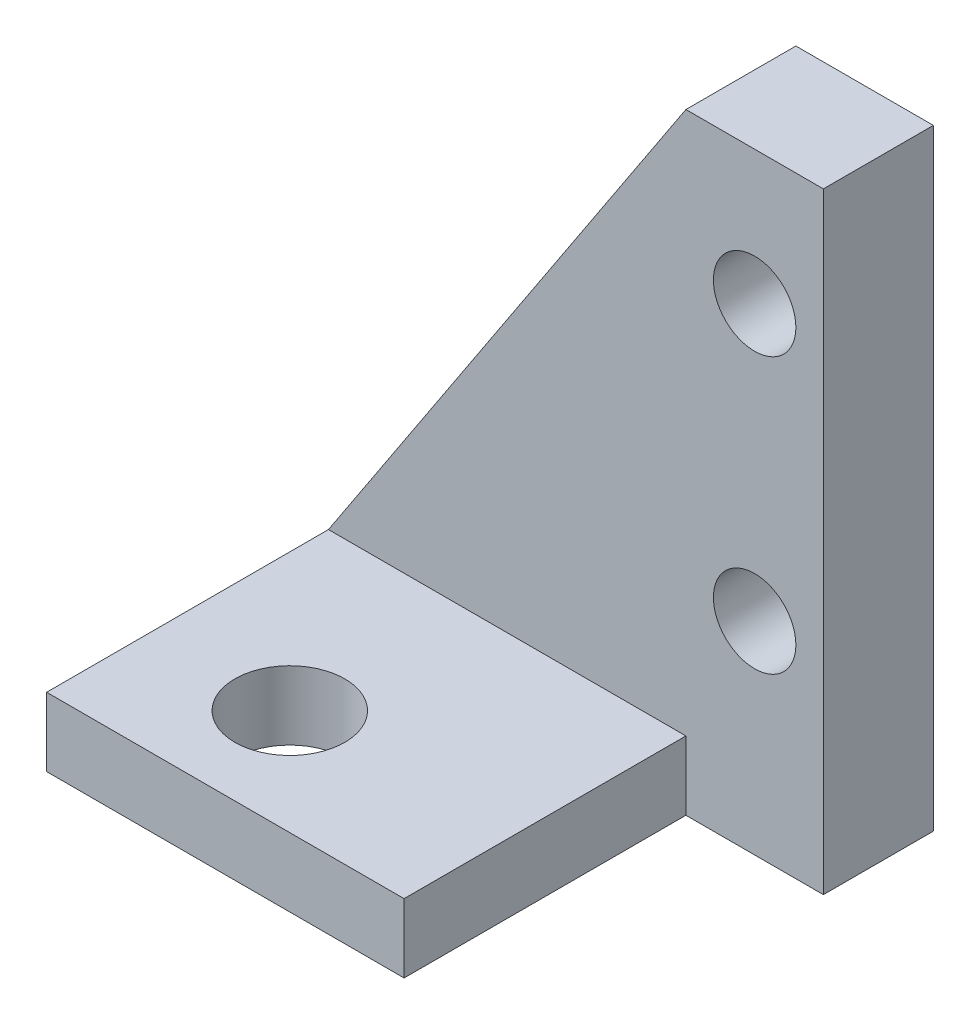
ISO-10303-21;
HEADER;
FILE_DESCRIPTION(('STEP AP214'),'2;1');
FILE_NAME('part.step','',(''),(''),'','','');
FILE_SCHEMA(('AUTOMOTIVE_DESIGN { 1 0 10303 214 1 1 1 1 }'));
ENDSEC;
DATA;
#1=APPLICATION_CONTEXT('core data for automotive mechanical design processes');
#2=APPLICATION_PROTOCOL_DEFINITION('international standard','automotive_design',2000,#1);
#3=PRODUCT_CONTEXT('',#1,'mechanical');
#4=PRODUCT('Part','Part','',(#3));
#5=PRODUCT_RELATED_PRODUCT_CATEGORY('part','',(#4));
#6=PRODUCT_DEFINITION_FORMATION('','',#4);
#7=PRODUCT_DEFINITION_CONTEXT('part definition',#1,'design');
#8=PRODUCT_DEFINITION('design','',#6,#7);
#9=PRODUCT_DEFINITION_SHAPE('','',#8);
#10=(LENGTH_UNIT() NAMED_UNIT(*) SI_UNIT(.MILLI.,.METRE.));
#11=(NAMED_UNIT(*) PLANE_ANGLE_UNIT() SI_UNIT($,.RADIAN.));
#12=(NAMED_UNIT(*) SI_UNIT($,.STERADIAN.) SOLID_ANGLE_UNIT());
#13=UNCERTAINTY_MEASURE_WITH_UNIT(LENGTH_MEASURE(1.E-05),#10,'distance_accuracy_value','');
#14=(GEOMETRIC_REPRESENTATION_CONTEXT(3) GLOBAL_UNCERTAINTY_ASSIGNED_CONTEXT((#13)) GLOBAL_UNIT_ASSIGNED_CONTEXT((#10,
#11,#12)) REPRESENTATION_CONTEXT('',''));
#15=CARTESIAN_POINT('',(0.,0.,0.));
#16=DIRECTION('',(0.,0.,1.));
#17=DIRECTION('',(1.,0.,0.));
#18=AXIS2_PLACEMENT_3D('',#15,#16,#17);
#19=CARTESIAN_POINT('',(-7.89857621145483,2.5,-6.5));
#20=DIRECTION('',(0.,1.,0.));
#21=DIRECTION('',(0.,0.,1.));
#22=AXIS2_PLACEMENT_3D('',#19,#20,#21);
#23=PLANE('',#22);
#24=CARTESIAN_POINT('',(2.,2.5,-2.58760280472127));
#25=DIRECTION('',(0.,1.,0.));
#26=DIRECTION('',(0.,0.,1.));
#27=AXIS2_PLACEMENT_3D('',#24,#25,#26);
#28=CIRCLE('',#27,2.);
#29=CARTESIAN_POINT('',(2.,2.5,-0.587602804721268));
#30=VERTEX_POINT('',#29);
#31=EDGE_CURVE('E131',#30,#30,#28,.T.);
#32=ORIENTED_EDGE('',*,*,#31,.F.);
#33=EDGE_LOOP('',(#32));
#34=FACE_BOUND('',#33,.T.);
#35=DIRECTION('',(0.,0.,-1.));
#36=VECTOR('',#35,1.);
#37=CARTESIAN_POINT('',(9.99999999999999,2.5,-6.5));
#38=LINE('',#37,#36);
#39=CARTESIAN_POINT('',(9.99999999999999,2.5,1.25665193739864));
#40=VERTEX_POINT('',#39);
#41=CARTESIAN_POINT('',(9.99999999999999,2.5,-8.99269458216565));
#42=VERTEX_POINT('',#41);
#43=EDGE_CURVE('E11',#40,#42,#38,.T.);
#44=ORIENTED_EDGE('',*,*,#43,.T.);
#45=DIRECTION('',(1.,0.,0.));
#46=VECTOR('',#45,1.);
#47=CARTESIAN_POINT('',(-3.,2.5,-8.99269458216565));
#48=LINE('',#47,#46);
#49=CARTESIAN_POINT('',(-3.,2.5,-8.99269458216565));
#50=VERTEX_POINT('',#49);
#51=EDGE_CURVE('E110',#50,#42,#48,.T.);
#52=ORIENTED_EDGE('',*,*,#51,.F.);
#53=DIRECTION('',(0.,0.,1.));
#54=VECTOR('',#53,1.);
#55=CARTESIAN_POINT('',(-3.,2.5,1.25665193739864));
#56=LINE('',#55,#54);
#57=CARTESIAN_POINT('',(-3.,2.5,1.25665193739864));
#58=VERTEX_POINT('',#57);
#59=EDGE_CURVE('E94',#50,#58,#56,.T.);
#60=ORIENTED_EDGE('',*,*,#59,.T.);
#61=DIRECTION('',(1.,0.,0.));
#62=VECTOR('',#61,1.);
#63=CARTESIAN_POINT('',(0.,2.5,1.25665193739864));
#64=LINE('',#63,#62);
#65=EDGE_CURVE('E161',#58,#40,#64,.T.);
#66=ORIENTED_EDGE('',*,*,#65,.T.);
#67=EDGE_LOOP('',(#44,#52,#60,#66));
#68=FACE_BOUND('',#67,.T.);
#69=ADVANCED_FACE('F35',(#34,#68),#23,.T.);
#70=CARTESIAN_POINT('',(9.99999999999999,2.5,-6.5));
#71=DIRECTION('',(-1.,0.,0.));
#72=DIRECTION('',(0.,0.,1.));
#73=AXIS2_PLACEMENT_3D('',#70,#71,#72);
#74=PLANE('',#73);
#75=DIRECTION('',(0.,0.,-1.));
#76=VECTOR('',#75,1.);
#77=CARTESIAN_POINT('',(9.99999999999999,0.,-6.5));
#78=LINE('',#77,#76);
#79=CARTESIAN_POINT('',(9.99999999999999,0.,1.25665193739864));
#80=VERTEX_POINT('',#79);
#81=CARTESIAN_POINT('',(10.,0.,-8.99269458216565));
#82=VERTEX_POINT('',#81);
#83=EDGE_CURVE('E45',#80,#82,#78,.T.);
#84=ORIENTED_EDGE('',*,*,#83,.T.);
#85=DIRECTION('',(0.,1.,0.));
#86=VECTOR('',#85,1.);
#87=CARTESIAN_POINT('',(10.,0.,-8.99269458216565));
#88=LINE('',#87,#86);
#89=EDGE_CURVE('E158',#82,#42,#88,.T.);
#90=ORIENTED_EDGE('',*,*,#89,.T.);
#91=ORIENTED_EDGE('',*,*,#43,.F.);
#92=DIRECTION('',(0.,1.,0.));
#93=VECTOR('',#92,1.);
#94=CARTESIAN_POINT('',(9.99999999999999,0.,1.25665193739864));
#95=LINE('',#94,#93);
#96=EDGE_CURVE('E226',#80,#40,#95,.T.);
#97=ORIENTED_EDGE('',*,*,#96,.F.);
#98=EDGE_LOOP('',(#84,#90,#91,#97));
#99=FACE_BOUND('',#98,.T.);
#100=ADVANCED_FACE('F37',(#99),#74,.F.);
#101=CARTESIAN_POINT('',(-7.89857621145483,0.,-6.5));
#102=DIRECTION('',(0.,1.,0.));
#103=DIRECTION('',(0.,0.,1.));
#104=AXIS2_PLACEMENT_3D('',#101,#102,#103);
#105=PLANE('',#104);
#106=CARTESIAN_POINT('',(2.,0.,-2.58760280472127));
#107=DIRECTION('',(0.,1.,0.));
#108=DIRECTION('',(0.,0.,1.));
#109=AXIS2_PLACEMENT_3D('',#106,#107,#108);
#110=CIRCLE('',#109,2.);
#111=CARTESIAN_POINT('',(2.,0.,-0.587602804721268));
#112=VERTEX_POINT('',#111);
#113=EDGE_CURVE('E107',#112,#112,#110,.T.);
#114=ORIENTED_EDGE('',*,*,#113,.T.);
#115=EDGE_LOOP('',(#114));
#116=FACE_BOUND('',#115,.T.);
#117=DIRECTION('',(1.,0.,0.));
#118=VECTOR('',#117,1.);
#119=CARTESIAN_POINT('',(0.,0.,1.25665193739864));
#120=LINE('',#119,#118);
#121=CARTESIAN_POINT('',(-3.,0.,1.25665193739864));
#122=VERTEX_POINT('',#121);
#123=EDGE_CURVE('E166',#122,#80,#120,.T.);
#124=ORIENTED_EDGE('',*,*,#123,.F.);
#125=DIRECTION('',(0.,0.,1.));
#126=VECTOR('',#125,1.);
#127=CARTESIAN_POINT('',(-3.,0.,1.25665193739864));
#128=LINE('',#127,#126);
#129=CARTESIAN_POINT('',(-3.,0.,-12.9926945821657));
#130=VERTEX_POINT('',#129);
#131=EDGE_CURVE('E121',#130,#122,#128,.T.);
#132=ORIENTED_EDGE('',*,*,#131,.F.);
#133=DIRECTION('',(-1.,0.,0.));
#134=VECTOR('',#133,1.);
#135=CARTESIAN_POINT('',(10.,0.,-12.9926945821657));
#136=LINE('',#135,#134);
#137=CARTESIAN_POINT('',(15.,0.,-12.9926945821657));
#138=VERTEX_POINT('',#137);
#139=EDGE_CURVE('E230',#138,#130,#136,.T.);
#140=ORIENTED_EDGE('',*,*,#139,.F.);
#141=DIRECTION('',(0.,0.,-1.));
#142=VECTOR('',#141,1.);
#143=CARTESIAN_POINT('',(15.,0.,-12.9926945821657));
#144=LINE('',#143,#142);
#145=CARTESIAN_POINT('',(15.,0.,-8.99269458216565));
#146=VERTEX_POINT('',#145);
#147=EDGE_CURVE('E155',#146,#138,#144,.T.);
#148=ORIENTED_EDGE('',*,*,#147,.F.);
#149=DIRECTION('',(1.,0.,0.));
#150=VECTOR('',#149,1.);
#151=CARTESIAN_POINT('',(10.,0.,-8.99269458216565));
#152=LINE('',#151,#150);
#153=EDGE_CURVE('E154',#82,#146,#152,.T.);
#154=ORIENTED_EDGE('',*,*,#153,.F.);
#155=ORIENTED_EDGE('',*,*,#83,.F.);
#156=EDGE_LOOP('',(#124,#132,#140,#148,#154,#155));
#157=FACE_BOUND('',#156,.T.);
#158=ADVANCED_FACE('F208',(#116,#157),#105,.F.);
#159=CARTESIAN_POINT('',(10.,0.,-12.9926945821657));
#160=DIRECTION('',(0.,0.,-1.));
#161=DIRECTION('',(-1.,0.,0.));
#162=AXIS2_PLACEMENT_3D('',#159,#160,#161);
#163=PLANE('',#162);
#164=CARTESIAN_POINT('',(12.5,7.365,-12.9926945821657));
#165=DIRECTION('',(0.,0.,-1.));
#166=DIRECTION('',(-1.,0.,0.));
#167=AXIS2_PLACEMENT_3D('',#164,#165,#166);
#168=CIRCLE('',#167,1.5);
#169=CARTESIAN_POINT('',(11.,7.365,-12.9926945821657));
#170=VERTEX_POINT('',#169);
#171=EDGE_CURVE('E139',#170,#170,#168,.T.);
#172=ORIENTED_EDGE('',*,*,#171,.F.);
#173=EDGE_LOOP('',(#172));
#174=FACE_BOUND('',#173,.T.);
#175=CARTESIAN_POINT('',(12.5,17.365,-12.9926945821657));
#176=DIRECTION('',(0.,0.,-1.));
#177=DIRECTION('',(-1.,0.,0.));
#178=AXIS2_PLACEMENT_3D('',#175,#176,#177);
#179=CIRCLE('',#178,1.5);
#180=CARTESIAN_POINT('',(11.,17.365,-12.9926945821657));
#181=VERTEX_POINT('',#180);
#182=EDGE_CURVE('E143',#181,#181,#179,.T.);
#183=ORIENTED_EDGE('',*,*,#182,.F.);
#184=EDGE_LOOP('',(#183));
#185=FACE_BOUND('',#184,.T.);
#186=DIRECTION('',(0.,1.,0.));
#187=VECTOR('',#186,1.);
#188=CARTESIAN_POINT('',(-3.,0.,-12.9926945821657));
#189=LINE('',#188,#187);
#190=CARTESIAN_POINT('',(-3.,2.5,-12.9926945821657));
#191=VERTEX_POINT('',#190);
#192=EDGE_CURVE('E134',#130,#191,#189,.T.);
#193=ORIENTED_EDGE('',*,*,#192,.T.);
#194=DIRECTION('',(-0.55019935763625,-0.835033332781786,0.));
#195=VECTOR('',#194,1.);
#196=CARTESIAN_POINT('',(9.99999999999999,22.23,-12.9926945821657));
#197=LINE('',#196,#195);
#198=CARTESIAN_POINT('',(9.99999999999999,22.23,-12.9926945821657));
#199=VERTEX_POINT('',#198);
#200=EDGE_CURVE('E114',#199,#191,#197,.T.);
#201=ORIENTED_EDGE('',*,*,#200,.F.);
#202=DIRECTION('',(-1.,0.,0.));
#203=VECTOR('',#202,1.);
#204=CARTESIAN_POINT('',(15.,22.23,-12.9926945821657));
#205=LINE('',#204,#203);
#206=CARTESIAN_POINT('',(15.,22.23,-12.9926945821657));
#207=VERTEX_POINT('',#206);
#208=EDGE_CURVE('E149',#207,#199,#205,.T.);
#209=ORIENTED_EDGE('',*,*,#208,.F.);
#210=DIRECTION('',(0.,1.,0.));
#211=VECTOR('',#210,1.);
#212=CARTESIAN_POINT('',(15.,0.,-12.9926945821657));
#213=LINE('',#212,#211);
#214=EDGE_CURVE('E159',#138,#207,#213,.T.);
#215=ORIENTED_EDGE('',*,*,#214,.F.);
#216=ORIENTED_EDGE('',*,*,#139,.T.);
#217=EDGE_LOOP('',(#193,#201,#209,#215,#216));
#218=FACE_BOUND('',#217,.T.);
#219=ADVANCED_FACE('F212',(#174,#185,#218),#163,.T.);
#220=CARTESIAN_POINT('',(0.,0.,1.25665193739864));
#221=DIRECTION('',(0.,0.,1.));
#222=DIRECTION('',(1.,0.,0.));
#223=AXIS2_PLACEMENT_3D('',#220,#221,#222);
#224=PLANE('',#223);
#225=ORIENTED_EDGE('',*,*,#65,.F.);
#226=DIRECTION('',(0.,1.,0.));
#227=VECTOR('',#226,1.);
#228=CARTESIAN_POINT('',(-3.,0.,1.25665193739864));
#229=LINE('',#228,#227);
#230=EDGE_CURVE('E103',#122,#58,#229,.T.);
#231=ORIENTED_EDGE('',*,*,#230,.F.);
#232=ORIENTED_EDGE('',*,*,#123,.T.);
#233=ORIENTED_EDGE('',*,*,#96,.T.);
#234=EDGE_LOOP('',(#225,#231,#232,#233));
#235=FACE_BOUND('',#234,.T.);
#236=ADVANCED_FACE('F219',(#235),#224,.T.);
#237=CARTESIAN_POINT('',(15.,0.,-12.9926945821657));
#238=DIRECTION('',(1.,0.,0.));
#239=DIRECTION('',(0.,0.,-1.));
#240=AXIS2_PLACEMENT_3D('',#237,#238,#239);
#241=PLANE('',#240);
#242=ORIENTED_EDGE('',*,*,#214,.T.);
#243=DIRECTION('',(0.,0.,-1.));
#244=VECTOR('',#243,1.);
#245=CARTESIAN_POINT('',(15.,22.23,-8.99269458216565));
#246=LINE('',#245,#244);
#247=CARTESIAN_POINT('',(15.,22.23,-8.99269458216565));
#248=VERTEX_POINT('',#247);
#249=EDGE_CURVE('E146',#248,#207,#246,.T.);
#250=ORIENTED_EDGE('',*,*,#249,.F.);
#251=DIRECTION('',(0.,1.,0.));
#252=VECTOR('',#251,1.);
#253=CARTESIAN_POINT('',(15.,0.,-8.99269458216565));
#254=LINE('',#253,#252);
#255=EDGE_CURVE('E162',#146,#248,#254,.T.);
#256=ORIENTED_EDGE('',*,*,#255,.F.);
#257=ORIENTED_EDGE('',*,*,#147,.T.);
#258=EDGE_LOOP('',(#242,#250,#256,#257));
#259=FACE_BOUND('',#258,.T.);
#260=ADVANCED_FACE('F186',(#259),#241,.T.);
#261=CARTESIAN_POINT('',(10.,0.,-8.99269458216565));
#262=DIRECTION('',(0.,0.,1.));
#263=DIRECTION('',(1.,0.,0.));
#264=AXIS2_PLACEMENT_3D('',#261,#262,#263);
#265=PLANE('',#264);
#266=CARTESIAN_POINT('',(12.5,7.365,-8.99269458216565));
#267=DIRECTION('',(0.,0.,1.));
#268=DIRECTION('',(1.,0.,0.));
#269=AXIS2_PLACEMENT_3D('',#266,#267,#268);
#270=CIRCLE('',#269,1.5);
#271=CARTESIAN_POINT('',(14.,7.365,-8.99269458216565));
#272=VERTEX_POINT('',#271);
#273=EDGE_CURVE('E137',#272,#272,#270,.T.);
#274=ORIENTED_EDGE('',*,*,#273,.F.);
#275=EDGE_LOOP('',(#274));
#276=FACE_BOUND('',#275,.T.);
#277=CARTESIAN_POINT('',(12.5,17.365,-8.99269458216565));
#278=DIRECTION('',(0.,0.,1.));
#279=DIRECTION('',(1.,0.,0.));
#280=AXIS2_PLACEMENT_3D('',#277,#278,#279);
#281=CIRCLE('',#280,1.5);
#282=CARTESIAN_POINT('',(14.,17.365,-8.99269458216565));
#283=VERTEX_POINT('',#282);
#284=EDGE_CURVE('E142',#283,#283,#281,.T.);
#285=ORIENTED_EDGE('',*,*,#284,.F.);
#286=EDGE_LOOP('',(#285));
#287=FACE_BOUND('',#286,.T.);
#288=ORIENTED_EDGE('',*,*,#255,.T.);
#289=DIRECTION('',(1.,0.,0.));
#290=VECTOR('',#289,1.);
#291=CARTESIAN_POINT('',(15.,22.23,-8.99269458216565));
#292=LINE('',#291,#290);
#293=CARTESIAN_POINT('',(9.99999999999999,22.23,-8.99269458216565));
#294=VERTEX_POINT('',#293);
#295=EDGE_CURVE('E125',#294,#248,#292,.T.);
#296=ORIENTED_EDGE('',*,*,#295,.F.);
#297=DIRECTION('',(-0.55019935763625,-0.835033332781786,0.));
#298=VECTOR('',#297,1.);
#299=CARTESIAN_POINT('',(9.99999999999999,22.23,-8.99269458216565));
#300=LINE('',#299,#298);
#301=EDGE_CURVE('E115',#294,#50,#300,.T.);
#302=ORIENTED_EDGE('',*,*,#301,.T.);
#303=ORIENTED_EDGE('',*,*,#51,.T.);
#304=ORIENTED_EDGE('',*,*,#89,.F.);
#305=ORIENTED_EDGE('',*,*,#153,.T.);
#306=EDGE_LOOP('',(#288,#296,#302,#303,#304,#305));
#307=FACE_BOUND('',#306,.T.);
#308=ADVANCED_FACE('F123',(#276,#287,#307),#265,.T.);
#309=CARTESIAN_POINT('',(15.,22.23,-12.9926945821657));
#310=DIRECTION('',(0.,1.,0.));
#311=DIRECTION('',(0.,0.,1.));
#312=AXIS2_PLACEMENT_3D('',#309,#310,#311);
#313=PLANE('',#312);
#314=ORIENTED_EDGE('',*,*,#249,.T.);
#315=ORIENTED_EDGE('',*,*,#208,.T.);
#316=DIRECTION('',(0.,0.,1.));
#317=VECTOR('',#316,1.);
#318=CARTESIAN_POINT('',(9.99999999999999,22.23,-8.99269458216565));
#319=LINE('',#318,#317);
#320=EDGE_CURVE('E151',#199,#294,#319,.T.);
#321=ORIENTED_EDGE('',*,*,#320,.T.);
#322=ORIENTED_EDGE('',*,*,#295,.T.);
#323=EDGE_LOOP('',(#314,#315,#321,#322));
#324=FACE_BOUND('',#323,.T.);
#325=ADVANCED_FACE('F185',(#324),#313,.T.);
#326=CARTESIAN_POINT('',(12.5,17.365,-22.));
#327=DIRECTION('',(0.,0.,1.));
#328=DIRECTION('',(1.,0.,0.));
#329=AXIS2_PLACEMENT_3D('',#326,#327,#328);
#330=CYLINDRICAL_SURFACE('',#329,1.5);
#331=ORIENTED_EDGE('',*,*,#182,.T.);
#332=EDGE_LOOP('',(#331));
#333=FACE_BOUND('',#332,.T.);
#334=ORIENTED_EDGE('',*,*,#284,.T.);
#335=EDGE_LOOP('',(#334));
#336=FACE_BOUND('',#335,.T.);
#337=ADVANCED_FACE('F190',(#333,#336),#330,.F.);
#338=CARTESIAN_POINT('',(12.5,7.365,-22.));
#339=DIRECTION('',(0.,0.,1.));
#340=DIRECTION('',(1.,0.,0.));
#341=AXIS2_PLACEMENT_3D('',#338,#339,#340);
#342=CYLINDRICAL_SURFACE('',#341,1.5);
#343=ORIENTED_EDGE('',*,*,#171,.T.);
#344=EDGE_LOOP('',(#343));
#345=FACE_BOUND('',#344,.T.);
#346=ORIENTED_EDGE('',*,*,#273,.T.);
#347=EDGE_LOOP('',(#346));
#348=FACE_BOUND('',#347,.T.);
#349=ADVANCED_FACE('F181',(#345,#348),#342,.F.);
#350=CARTESIAN_POINT('',(-3.,0.,1.25665193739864));
#351=DIRECTION('',(-1.,0.,0.));
#352=DIRECTION('',(0.,0.,1.));
#353=AXIS2_PLACEMENT_3D('',#350,#351,#352);
#354=PLANE('',#353);
#355=EDGE_CURVE('E99',#191,#50,#56,.T.);
#356=ORIENTED_EDGE('',*,*,#355,.F.);
#357=ORIENTED_EDGE('',*,*,#192,.F.);
#358=ORIENTED_EDGE('',*,*,#131,.T.);
#359=ORIENTED_EDGE('',*,*,#230,.T.);
#360=ORIENTED_EDGE('',*,*,#59,.F.);
#361=EDGE_LOOP('',(#356,#357,#358,#359,#360));
#362=FACE_BOUND('',#361,.T.);
#363=ADVANCED_FACE('F96',(#362),#354,.T.);
#364=CARTESIAN_POINT('',(2.,0.,-2.58760280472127));
#365=DIRECTION('',(0.,1.,0.));
#366=DIRECTION('',(0.,0.,1.));
#367=AXIS2_PLACEMENT_3D('',#364,#365,#366);
#368=CYLINDRICAL_SURFACE('',#367,2.);
#369=ORIENTED_EDGE('',*,*,#113,.F.);
#370=EDGE_LOOP('',(#369));
#371=FACE_BOUND('',#370,.T.);
#372=ORIENTED_EDGE('',*,*,#31,.T.);
#373=EDGE_LOOP('',(#372));
#374=FACE_BOUND('',#373,.T.);
#375=ADVANCED_FACE('F280',(#371,#374),#368,.F.);
#376=CARTESIAN_POINT('',(9.99999999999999,22.23,-12.9926945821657));
#377=DIRECTION('',(-0.835033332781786,0.55019935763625,0.));
#378=DIRECTION('',(-0.55019935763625,-0.835033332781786,0.));
#379=AXIS2_PLACEMENT_3D('',#376,#377,#378);
#380=PLANE('',#379);
#381=ORIENTED_EDGE('',*,*,#301,.F.);
#382=ORIENTED_EDGE('',*,*,#320,.F.);
#383=ORIENTED_EDGE('',*,*,#200,.T.);
#384=ORIENTED_EDGE('',*,*,#355,.T.);
#385=EDGE_LOOP('',(#381,#382,#383,#384));
#386=FACE_BOUND('',#385,.T.);
#387=ADVANCED_FACE('F118',(#386),#380,.T.);
#388=CLOSED_SHELL('',(#69,#100,#158,#219,#236,#260,#308,#325,#337,#349,#363,#375,#387));
#389=MANIFOLD_SOLID_BREP('B2',#388);
#390=ADVANCED_BREP_SHAPE_REPRESENTATION('',(#18,#389),#14);
#391=SHAPE_DEFINITION_REPRESENTATION(#9,#390);
ENDSEC;
END-ISO-10303-21;
